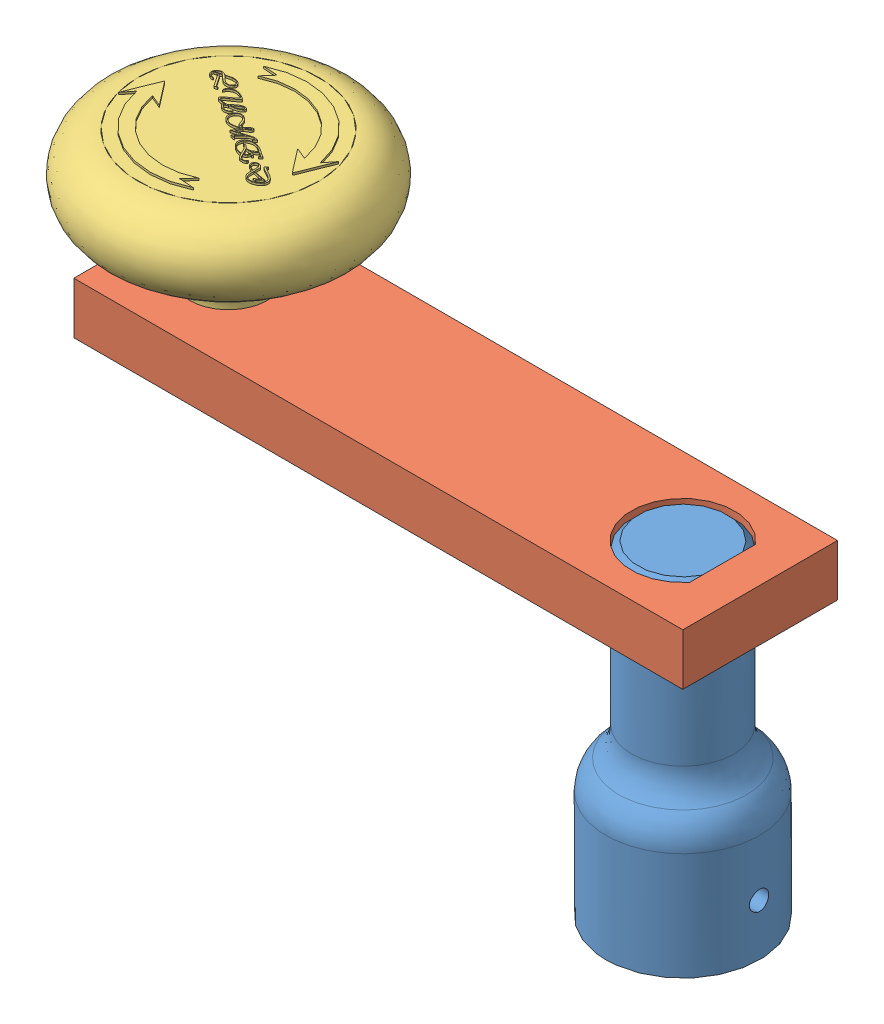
SolidWorks assembly crank sub.SLDASM, configuration Default (file format 12000). Lengths in mm.
Overall size (87.48 56.13 44.01).
3 component instances, 3 part files, 5 mates.
Components (placement in the parent):
- crank-shaft-1: crank-shaft.sldprt [Default] at origin size (18.92 40 18.92)
- crank-arm-1: crank-arm.sldprt [Default] at (-65.475 33.65 -9.525) size (75 6.35 19.05)
- crank-knob-1: crank-knob.sldprt [Default] at (-55.95 33.65 0) x (0.8335 0 0.55252) z (-0.55252 0 0.8335) size (31.75 22.48 31.75)
Mates (geometry in assembly coordinates):
- Concentric1: concentric anti-aligned: cylinder of crank-shaft-1 through (0 40 0) axis (0 -1 0) radius 6.2865; cylinder of crank-arm-1 through (0 33.65 0) axis (0 1 0) radius 6.35
- Parallel1: parallel anti-aligned: plane of crank-shaft-1 through (4.8895 33.65 3.9513) normal (1 0 0); plane of crank-arm-1 through (4.8895 33.65 -4.0516) normal (-1 0 0)
- Coincident2: coincident: plane of crank-shaft-1 through (0 33.65 0) normal (0 1 0); line of crank-arm-1 through (9.525 33.65 9.525) axis (0 0 -1)
- Concentric2: concentric anti-aligned: cylinder of crank-arm-1 through (-55.95 33.65 0) axis (0 1 0) radius 2.3813; cylinder of crank-knob-1 through (-55.95 33.65 0) axis (0 -1 0) radius 2.286
- Coincident3: coincident anti-aligned: plane of crank-arm-1 through (9.525 40 9.525) normal (0 1 0); plane of crank-knob-1 through (-51.9805 40 2.6314) normal (0 -1 0)
